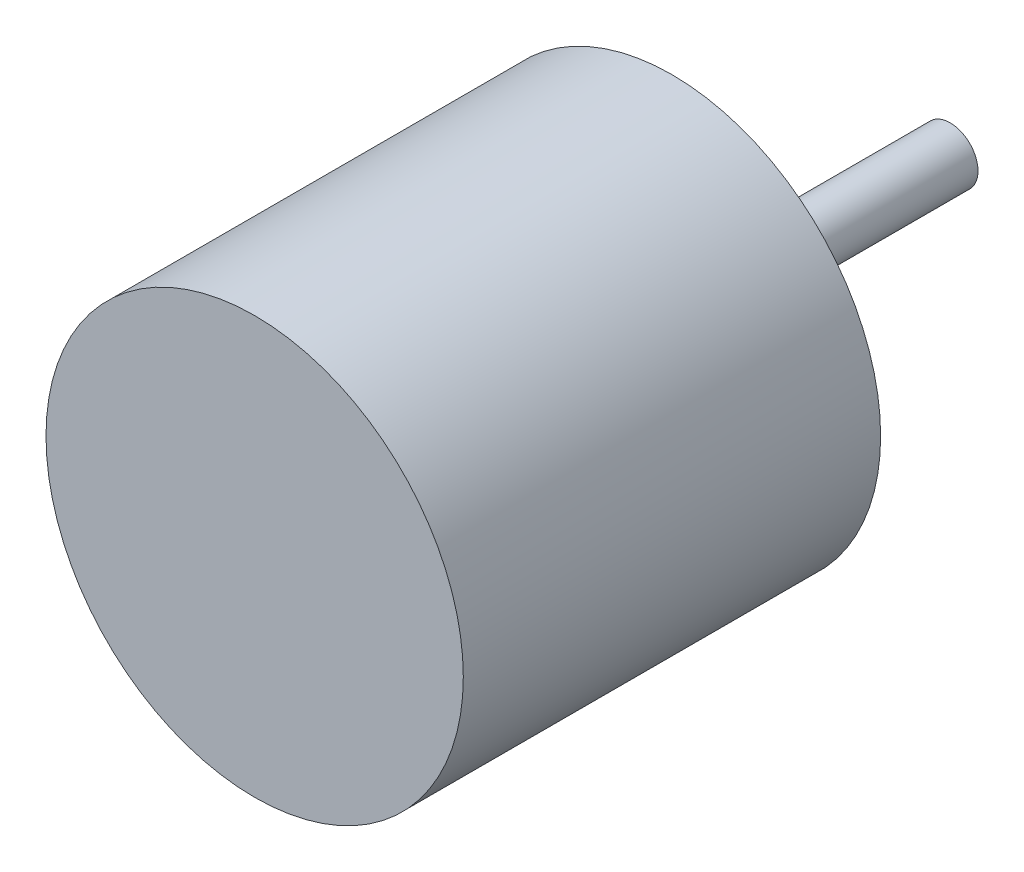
from build123d import *

# Parameters (mm, degrees)
ESQUISSE1_R      = 10
EXTRUSION1_DEPTH = 100
ESQUISSE2_R      = 75
EXTRUSION2_DEPTH = 150


with BuildPart() as part:
    # Esquisse1 → Extrusion1 (new body)
    with BuildSketch(Plane.XY):
        Circle(ESQUISSE1_R)
    extrude(amount=EXTRUSION1_DEPTH)

    # Esquisse2 → Extrusion2 (add)
    with BuildSketch(Plane.XY.offset(100)):
        Circle(ESQUISSE2_R)
    extrude(amount=EXTRUSION2_DEPTH)


solid = part.part
